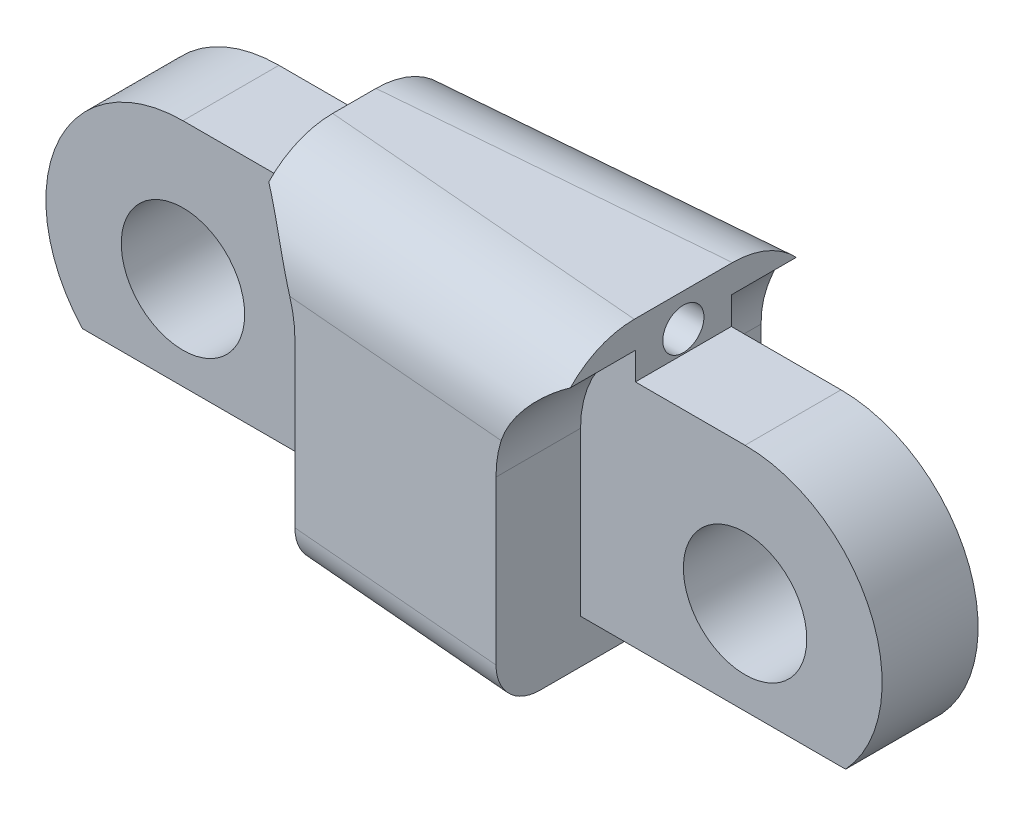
ISO-10303-21;
HEADER;
FILE_DESCRIPTION(('STEP AP214'),'2;1');
FILE_NAME('part.step','',(''),(''),'','','');
FILE_SCHEMA(('AUTOMOTIVE_DESIGN { 1 0 10303 214 1 1 1 1 }'));
ENDSEC;
DATA;
#1=APPLICATION_CONTEXT('core data for automotive mechanical design processes');
#2=APPLICATION_PROTOCOL_DEFINITION('international standard','automotive_design',2000,#1);
#3=PRODUCT_CONTEXT('',#1,'mechanical');
#4=PRODUCT('Part','Part','',(#3));
#5=PRODUCT_RELATED_PRODUCT_CATEGORY('part','',(#4));
#6=PRODUCT_DEFINITION_FORMATION('','',#4);
#7=PRODUCT_DEFINITION_CONTEXT('part definition',#1,'design');
#8=PRODUCT_DEFINITION('design','',#6,#7);
#9=PRODUCT_DEFINITION_SHAPE('','',#8);
#10=(LENGTH_UNIT() NAMED_UNIT(*) SI_UNIT(.MILLI.,.METRE.));
#11=(NAMED_UNIT(*) PLANE_ANGLE_UNIT() SI_UNIT($,.RADIAN.));
#12=(NAMED_UNIT(*) SI_UNIT($,.STERADIAN.) SOLID_ANGLE_UNIT());
#13=UNCERTAINTY_MEASURE_WITH_UNIT(LENGTH_MEASURE(1.E-05),#10,'distance_accuracy_value','');
#14=(GEOMETRIC_REPRESENTATION_CONTEXT(3) GLOBAL_UNCERTAINTY_ASSIGNED_CONTEXT((#13)) GLOBAL_UNIT_ASSIGNED_CONTEXT((#10,
#11,#12)) REPRESENTATION_CONTEXT('',''));
#15=CARTESIAN_POINT('',(0.,0.,0.));
#16=DIRECTION('',(0.,0.,1.));
#17=DIRECTION('',(1.,0.,0.));
#18=AXIS2_PLACEMENT_3D('',#15,#16,#17);
#19=CARTESIAN_POINT('',(0.,0.,0.));
#20=DIRECTION('',(0.,-1.,0.));
#21=DIRECTION('',(0.,0.,-1.));
#22=AXIS2_PLACEMENT_3D('',#19,#20,#21);
#23=PLANE('',#22);
#24=DIRECTION('',(0.,0.,-1.));
#25=VECTOR('',#24,1.);
#26=CARTESIAN_POINT('',(3.175,0.,7.9375));
#27=LINE('',#26,#25);
#28=CARTESIAN_POINT('',(3.175,0.,4.06577914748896));
#29=VERTEX_POINT('',#28);
#30=CARTESIAN_POINT('',(3.175,0.,-4.06577914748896));
#31=VERTEX_POINT('',#30);
#32=EDGE_CURVE('E503',#29,#31,#27,.T.);
#33=ORIENTED_EDGE('',*,*,#32,.T.);
#34=DIRECTION('',(-0.99654575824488,0.,0.08304547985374));
#35=VECTOR('',#34,1.);
#36=CARTESIAN_POINT('',(19.2609355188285,0.,-5.40627377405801));
#37=LINE('',#36,#35);
#38=CARTESIAN_POINT('',(15.875,0.,-5.1241124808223));
#39=VERTEX_POINT('',#38);
#40=EDGE_CURVE('E378',#31,#39,#37,.F.);
#41=ORIENTED_EDGE('',*,*,#40,.T.);
#42=DIRECTION('',(0.,0.,-1.));
#43=VECTOR('',#42,1.);
#44=CARTESIAN_POINT('',(15.875,0.,7.9375));
#45=LINE('',#44,#43);
#46=CARTESIAN_POINT('',(15.875,0.,5.1241124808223));
#47=VERTEX_POINT('',#46);
#48=EDGE_CURVE('E282',#47,#39,#45,.T.);
#49=ORIENTED_EDGE('',*,*,#48,.F.);
#50=DIRECTION('',(0.99654575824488,0.,0.08304547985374));
#51=VECTOR('',#50,1.);
#52=CARTESIAN_POINT('',(0.2109355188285,0.,3.818773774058));
#53=LINE('',#52,#51);
#54=EDGE_CURVE('E375',#47,#29,#53,.F.);
#55=ORIENTED_EDGE('',*,*,#54,.T.);
#56=EDGE_LOOP('',(#33,#41,#49,#55));
#57=FACE_BOUND('',#56,.T.);
#58=ADVANCED_FACE('F36',(#57),#23,.T.);
#59=CARTESIAN_POINT('',(-7.14375,0.,-2.778125));
#60=DIRECTION('',(0.,0.,1.));
#61=DIRECTION('',(1.,0.,0.));
#62=AXIS2_PLACEMENT_3D('',#59,#60,#61);
#63=PLANE('',#62);
#64=CARTESIAN_POINT('',(-7.14375,7.9375,-2.778125));
#65=DIRECTION('',(0.,0.,1.));
#66=DIRECTION('',(1.,0.,0.));
#67=AXIS2_PLACEMENT_3D('',#64,#65,#66);
#68=CIRCLE('',#67,3.571875);
#69=CARTESIAN_POINT('',(-3.571875,7.9375,-2.778125));
#70=VERTEX_POINT('',#69);
#71=EDGE_CURVE('E303',#70,#70,#68,.T.);
#72=ORIENTED_EDGE('',*,*,#71,.T.);
#73=EDGE_LOOP('',(#72));
#74=FACE_BOUND('',#73,.T.);
#75=DIRECTION('',(1.,0.,0.));
#76=VECTOR('',#75,1.);
#77=CARTESIAN_POINT('',(-7.14375,2.54,-2.778125));
#78=LINE('',#77,#76);
#79=CARTESIAN_POINT('',(-12.9636211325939,2.54,-2.778125));
#80=VERTEX_POINT('',#79);
#81=CARTESIAN_POINT('',(3.175,2.54,-2.778125));
#82=VERTEX_POINT('',#81);
#83=EDGE_CURVE('E236',#80,#82,#78,.T.);
#84=ORIENTED_EDGE('',*,*,#83,.F.);
#85=CARTESIAN_POINT('',(-7.14375,7.9375,-2.778125));
#86=DIRECTION('',(0.,0.,1.));
#87=DIRECTION('',(1.,0.,0.));
#88=AXIS2_PLACEMENT_3D('',#85,#86,#87);
#89=CIRCLE('',#88,7.9375);
#90=CARTESIAN_POINT('',(-7.14375,15.875,-2.778125));
#91=VERTEX_POINT('',#90);
#92=EDGE_CURVE('E309',#91,#80,#89,.T.);
#93=ORIENTED_EDGE('',*,*,#92,.F.);
#94=DIRECTION('',(1.,0.,0.));
#95=VECTOR('',#94,1.);
#96=CARTESIAN_POINT('',(-7.14375,15.875,-2.778125));
#97=LINE('',#96,#95);
#98=CARTESIAN_POINT('',(0.,15.875,-2.778125));
#99=VERTEX_POINT('',#98);
#100=EDGE_CURVE('E323',#91,#99,#97,.T.);
#101=ORIENTED_EDGE('',*,*,#100,.T.);
#102=DIRECTION('',(0.,1.,0.));
#103=VECTOR('',#102,1.);
#104=CARTESIAN_POINT('',(0.,17.4625,-2.778125));
#105=LINE('',#104,#103);
#106=CARTESIAN_POINT('',(0.,17.4625,-2.778125));
#107=VERTEX_POINT('',#106);
#108=EDGE_CURVE('E582',#99,#107,#105,.T.);
#109=ORIENTED_EDGE('',*,*,#108,.T.);
#110=CARTESIAN_POINT('',(-3.175,11.9632386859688,-2.778125));
#111=DIRECTION('',(0.,0.,-1.));
#112=DIRECTION('',(1.,0.,0.));
#113=AXIS2_PLACEMENT_3D('',#110,#111,#112);
#114=CIRCLE('',#113,6.35);
#115=CARTESIAN_POINT('',(3.175,11.9632386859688,-2.778125));
#116=VERTEX_POINT('',#115);
#117=EDGE_CURVE('E579',#107,#116,#114,.T.);
#118=ORIENTED_EDGE('',*,*,#117,.T.);
#119=DIRECTION('',(0.,-1.,0.));
#120=VECTOR('',#119,1.);
#121=CARTESIAN_POINT('',(3.175,0.,-2.778125));
#122=LINE('',#121,#120);
#123=EDGE_CURVE('E577',#116,#82,#122,.T.);
#124=ORIENTED_EDGE('',*,*,#123,.T.);
#125=EDGE_LOOP('',(#84,#93,#101,#109,#118,#124));
#126=FACE_BOUND('',#125,.T.);
#127=ADVANCED_FACE('F431',(#74,#126),#63,.F.);
#128=CARTESIAN_POINT('',(-7.14375,0.,2.778125));
#129=DIRECTION('',(0.,0.,-1.));
#130=DIRECTION('',(-1.,0.,0.));
#131=AXIS2_PLACEMENT_3D('',#128,#129,#130);
#132=PLANE('',#131);
#133=CARTESIAN_POINT('',(-7.14375,7.9375,2.778125));
#134=DIRECTION('',(0.,0.,1.));
#135=DIRECTION('',(1.,0.,0.));
#136=AXIS2_PLACEMENT_3D('',#133,#134,#135);
#137=CIRCLE('',#136,3.571875);
#138=CARTESIAN_POINT('',(-3.571875,7.9375,2.778125));
#139=VERTEX_POINT('',#138);
#140=EDGE_CURVE('E299',#139,#139,#137,.T.);
#141=ORIENTED_EDGE('',*,*,#140,.F.);
#142=EDGE_LOOP('',(#141));
#143=FACE_BOUND('',#142,.T.);
#144=DIRECTION('',(1.,0.,0.));
#145=VECTOR('',#144,1.);
#146=CARTESIAN_POINT('',(3.175,2.54,2.778125));
#147=LINE('',#146,#145);
#148=CARTESIAN_POINT('',(-12.9636211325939,2.54,2.778125));
#149=VERTEX_POINT('',#148);
#150=CARTESIAN_POINT('',(3.175,2.54,2.778125));
#151=VERTEX_POINT('',#150);
#152=EDGE_CURVE('E233',#149,#151,#147,.T.);
#153=ORIENTED_EDGE('',*,*,#152,.T.);
#154=DIRECTION('',(0.,-1.,0.));
#155=VECTOR('',#154,1.);
#156=CARTESIAN_POINT('',(3.175,0.,2.778125));
#157=LINE('',#156,#155);
#158=CARTESIAN_POINT('',(3.175,11.9632386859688,2.778125));
#159=VERTEX_POINT('',#158);
#160=EDGE_CURVE('E567',#159,#151,#157,.T.);
#161=ORIENTED_EDGE('',*,*,#160,.F.);
#162=CARTESIAN_POINT('',(-3.175,11.9632386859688,2.778125));
#163=DIRECTION('',(0.,0.,-1.));
#164=DIRECTION('',(1.,0.,0.));
#165=AXIS2_PLACEMENT_3D('',#162,#163,#164);
#166=CIRCLE('',#165,6.35);
#167=CARTESIAN_POINT('',(0.,17.4625,2.778125));
#168=VERTEX_POINT('',#167);
#169=EDGE_CURVE('E564',#168,#159,#166,.T.);
#170=ORIENTED_EDGE('',*,*,#169,.F.);
#171=DIRECTION('',(0.,1.,0.));
#172=VECTOR('',#171,1.);
#173=CARTESIAN_POINT('',(0.,17.4625,2.778125));
#174=LINE('',#173,#172);
#175=CARTESIAN_POINT('',(0.,15.875,2.778125));
#176=VERTEX_POINT('',#175);
#177=EDGE_CURVE('E560',#176,#168,#174,.T.);
#178=ORIENTED_EDGE('',*,*,#177,.F.);
#179=DIRECTION('',(1.,0.,0.));
#180=VECTOR('',#179,1.);
#181=CARTESIAN_POINT('',(-7.14375,15.875,2.778125));
#182=LINE('',#181,#180);
#183=CARTESIAN_POINT('',(-7.14375,15.875,2.778125));
#184=VERTEX_POINT('',#183);
#185=EDGE_CURVE('E328',#184,#176,#182,.T.);
#186=ORIENTED_EDGE('',*,*,#185,.F.);
#187=CARTESIAN_POINT('',(-7.14375,7.9375,2.778125));
#188=DIRECTION('',(0.,0.,1.));
#189=DIRECTION('',(1.,0.,0.));
#190=AXIS2_PLACEMENT_3D('',#187,#188,#189);
#191=CIRCLE('',#190,7.9375);
#192=EDGE_CURVE('E312',#184,#149,#191,.T.);
#193=ORIENTED_EDGE('',*,*,#192,.T.);
#194=EDGE_LOOP('',(#153,#161,#170,#178,#186,#193));
#195=FACE_BOUND('',#194,.T.);
#196=ADVANCED_FACE('F419',(#143,#195),#132,.F.);
#197=CARTESIAN_POINT('',(-7.14375,7.9375,-2.778125));
#198=DIRECTION('',(0.,0.,1.));
#199=DIRECTION('',(1.,0.,0.));
#200=AXIS2_PLACEMENT_3D('',#197,#198,#199);
#201=CYLINDRICAL_SURFACE('',#200,7.9375);
#202=DIRECTION('',(0.,0.,1.));
#203=VECTOR('',#202,1.);
#204=CARTESIAN_POINT('',(-12.9636211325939,2.54,-2.778125));
#205=LINE('',#204,#203);
#206=EDGE_CURVE('E237',#149,#80,#205,.F.);
#207=ORIENTED_EDGE('',*,*,#206,.F.);
#208=ORIENTED_EDGE('',*,*,#192,.F.);
#209=DIRECTION('',(0.,0.,-1.));
#210=VECTOR('',#209,1.);
#211=CARTESIAN_POINT('',(-7.14375,15.875,-2.778125));
#212=LINE('',#211,#210);
#213=EDGE_CURVE('E320',#184,#91,#212,.T.);
#214=ORIENTED_EDGE('',*,*,#213,.T.);
#215=ORIENTED_EDGE('',*,*,#92,.T.);
#216=EDGE_LOOP('',(#207,#208,#214,#215));
#217=FACE_BOUND('',#216,.T.);
#218=ADVANCED_FACE('F415',(#217),#201,.T.);
#219=CARTESIAN_POINT('',(0.,19.05,6.35));
#220=DIRECTION('',(1.,0.,0.));
#221=DIRECTION('',(0.,0.,-1.));
#222=AXIS2_PLACEMENT_3D('',#219,#220,#221);
#223=PLANE('',#222);
#224=CARTESIAN_POINT('',(0.,17.145,0.));
#225=DIRECTION('',(1.,0.,0.));
#226=DIRECTION('',(0.,0.,-1.));
#227=AXIS2_PLACEMENT_3D('',#224,#225,#226);
#228=CIRCLE('',#227,1.190625);
#229=CARTESIAN_POINT('',(0.,17.145,-1.190625));
#230=VERTEX_POINT('',#229);
#231=EDGE_CURVE('E584',#230,#230,#228,.F.);
#232=ORIENTED_EDGE('',*,*,#231,.F.);
#233=EDGE_LOOP('',(#232));
#234=FACE_BOUND('',#233,.T.);
#235=DIRECTION('',(0.,0.,1.));
#236=VECTOR('',#235,1.);
#237=CARTESIAN_POINT('',(0.,17.4625,-7.9375));
#238=LINE('',#237,#236);
#239=CARTESIAN_POINT('',(0.,17.4625,-4.95419519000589));
#240=VERTEX_POINT('',#239);
#241=EDGE_CURVE('E573',#240,#107,#238,.T.);
#242=ORIENTED_EDGE('',*,*,#241,.T.);
#243=ORIENTED_EDGE('',*,*,#108,.F.);
#244=DIRECTION('',(0.,0.,-1.));
#245=VECTOR('',#244,1.);
#246=CARTESIAN_POINT('',(0.,15.875,-2.778125));
#247=LINE('',#246,#245);
#248=EDGE_CURVE('E319',#176,#99,#247,.T.);
#249=ORIENTED_EDGE('',*,*,#248,.F.);
#250=ORIENTED_EDGE('',*,*,#177,.T.);
#251=DIRECTION('',(0.,0.,-1.));
#252=VECTOR('',#251,1.);
#253=CARTESIAN_POINT('',(0.,17.4625,7.9375));
#254=LINE('',#253,#252);
#255=CARTESIAN_POINT('',(0.,17.4625,4.95419519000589));
#256=VERTEX_POINT('',#255);
#257=EDGE_CURVE('E540',#256,#168,#254,.T.);
#258=ORIENTED_EDGE('',*,*,#257,.F.);
#259=CARTESIAN_POINT('',(0.,13.97,1.25239162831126));
#260=DIRECTION('',(1.,0.,0.));
#261=DIRECTION('',(0.,0.,1.));
#262=AXIS2_PLACEMENT_3D('',#259,#260,#261);
#263=ELLIPSE('',#262,5.09760837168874,5.08);
#264=CARTESIAN_POINT('',(0.,19.05,1.25239162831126));
#265=VERTEX_POINT('',#264);
#266=EDGE_CURVE('E355',#256,#265,#263,.F.);
#267=ORIENTED_EDGE('',*,*,#266,.T.);
#268=DIRECTION('',(0.,0.,1.));
#269=VECTOR('',#268,1.);
#270=CARTESIAN_POINT('',(0.,19.05,6.35));
#271=LINE('',#270,#269);
#272=CARTESIAN_POINT('',(0.,19.05,-1.25239162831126));
#273=VERTEX_POINT('',#272);
#274=EDGE_CURVE('E343',#273,#265,#271,.T.);
#275=ORIENTED_EDGE('',*,*,#274,.F.);
#276=CARTESIAN_POINT('',(0.,13.97,-1.25239162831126));
#277=DIRECTION('',(1.,0.,0.));
#278=DIRECTION('',(0.,0.,1.));
#279=AXIS2_PLACEMENT_3D('',#276,#277,#278);
#280=ELLIPSE('',#279,5.09760837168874,5.08);
#281=EDGE_CURVE('E357',#273,#240,#280,.F.);
#282=ORIENTED_EDGE('',*,*,#281,.T.);
#283=EDGE_LOOP('',(#242,#243,#249,#250,#258,#267,#275,#282));
#284=FACE_BOUND('',#283,.T.);
#285=ADVANCED_FACE('F418',(#234,#284),#223,.F.);
#286=CARTESIAN_POINT('',(0.,19.05,-6.35));
#287=DIRECTION('',(0.08304547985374,0.,0.99654575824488));
#288=DIRECTION('',(0.99654575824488,0.,-0.08304547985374));
#289=AXIS2_PLACEMENT_3D('',#286,#287,#288);
#290=PLANE('',#289);
#291=CARTESIAN_POINT('',(-3.175,11.9632386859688,-6.08541666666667));
#292=DIRECTION('',(0.08304547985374,0.,0.99654575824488));
#293=DIRECTION('',(-0.99654575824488,0.,0.08304547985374));
#294=AXIS2_PLACEMENT_3D('',#291,#292,#293);
#295=ELLIPSE('',#294,6.37201046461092,6.35);
#296=CARTESIAN_POINT('',(2.8495671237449,13.97,-6.58746392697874));
#297=VERTEX_POINT('',#296);
#298=CARTESIAN_POINT('',(3.175,11.9632386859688,-6.61458333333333));
#299=VERTEX_POINT('',#298);
#300=EDGE_CURVE('E569',#297,#299,#295,.F.);
#301=ORIENTED_EDGE('',*,*,#300,.F.);
#302=DIRECTION('',(-0.99654575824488,0.,0.08304547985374));
#303=VECTOR('',#302,1.);
#304=CARTESIAN_POINT('',(0.,13.97,-6.35));
#305=LINE('',#304,#303);
#306=CARTESIAN_POINT('',(16.2004328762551,13.97,-7.70003607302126));
#307=VERTEX_POINT('',#306);
#308=EDGE_CURVE('E360',#297,#307,#305,.F.);
#309=ORIENTED_EDGE('',*,*,#308,.T.);
#310=CARTESIAN_POINT('',(22.225,11.9632386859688,-8.20208333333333));
#311=DIRECTION('',(0.08304547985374,0.,0.99654575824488));
#312=DIRECTION('',(-0.99654575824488,0.,0.08304547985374));
#313=AXIS2_PLACEMENT_3D('',#310,#311,#312);
#314=ELLIPSE('',#313,6.37201046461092,6.35);
#315=CARTESIAN_POINT('',(15.875,11.9632386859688,-7.67291666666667));
#316=VERTEX_POINT('',#315);
#317=EDGE_CURVE('E524',#307,#316,#314,.T.);
#318=ORIENTED_EDGE('',*,*,#317,.T.);
#319=DIRECTION('',(0.,-1.,0.));
#320=VECTOR('',#319,1.);
#321=CARTESIAN_POINT('',(15.875,19.05,-7.67291666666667));
#322=LINE('',#321,#320);
#323=CARTESIAN_POINT('',(15.875,2.54,-7.67291666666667));
#324=VERTEX_POINT('',#323);
#325=EDGE_CURVE('E521',#316,#324,#322,.T.);
#326=ORIENTED_EDGE('',*,*,#325,.T.);
#327=DIRECTION('',(-0.99654575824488,0.,0.08304547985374));
#328=VECTOR('',#327,1.);
#329=CARTESIAN_POINT('',(0.,2.54,-6.35));
#330=LINE('',#329,#328);
#331=CARTESIAN_POINT('',(3.175,2.54,-6.61458333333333));
#332=VERTEX_POINT('',#331);
#333=EDGE_CURVE('E370',#324,#332,#330,.T.);
#334=ORIENTED_EDGE('',*,*,#333,.T.);
#335=DIRECTION('',(0.,-1.,0.));
#336=VECTOR('',#335,1.);
#337=CARTESIAN_POINT('',(3.17500000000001,19.05,-6.61458333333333));
#338=LINE('',#337,#336);
#339=EDGE_CURVE('E571',#299,#332,#338,.T.);
#340=ORIENTED_EDGE('',*,*,#339,.F.);
#341=EDGE_LOOP('',(#301,#309,#318,#326,#334,#340));
#342=FACE_BOUND('',#341,.T.);
#343=ADVANCED_FACE('F464',(#342),#290,.F.);
#344=CARTESIAN_POINT('',(-0.103646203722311,13.97,-1.24375444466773));
#345=DIRECTION('',(-0.99654575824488,0.,0.08304547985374));
#346=DIRECTION('',(0.08304547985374,0.,0.99654575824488));
#347=AXIS2_PLACEMENT_3D('',#344,#345,#346);
#348=CYLINDRICAL_SURFACE('',#347,5.08);
#349=ORIENTED_EDGE('',*,*,#308,.F.);
#350=CARTESIAN_POINT('',(2.8495671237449,13.97,-6.58746392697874));
#351=CARTESIAN_POINT('',(2.80548358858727,14.1024553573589,-6.58381457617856));
#352=CARTESIAN_POINT('',(2.75704308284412,14.23320874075,-6.57455748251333));
#353=CARTESIAN_POINT('',(2.65222898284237,14.4900926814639,-6.54587044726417));
#354=CARTESIAN_POINT('',(2.59586939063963,14.6162309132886,-6.52645829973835));
#355=CARTESIAN_POINT('',(2.47655169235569,14.8616695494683,-6.47876870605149));
#356=CARTESIAN_POINT('',(2.41367987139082,14.9810333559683,-6.45059924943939));
#357=CARTESIAN_POINT('',(2.28148017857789,15.213971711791,-6.3863770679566));
#358=CARTESIAN_POINT('',(2.2121490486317,15.3275432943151,-6.35032035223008));
#359=CARTESIAN_POINT('',(2.05111294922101,15.5738597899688,-6.26229037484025));
#360=CARTESIAN_POINT('',(1.95792788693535,15.7050126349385,-6.20856358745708));
#361=CARTESIAN_POINT('',(1.7639792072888,15.9575288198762,-6.09262644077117));
#362=CARTESIAN_POINT('',(1.66321402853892,16.0788901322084,-6.0304143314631));
#363=CARTESIAN_POINT('',(1.34978372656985,16.429498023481,-5.83284218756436));
#364=CARTESIAN_POINT('',(1.12687357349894,16.6439329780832,-5.68705578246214));
#365=CARTESIAN_POINT('',(0.751417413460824,16.9572261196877,-5.44064403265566));
#366=CARTESIAN_POINT('',(0.60562568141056,17.0683972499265,-5.34477313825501));
#367=CARTESIAN_POINT('',(0.381893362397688,17.2243378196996,-5.19903492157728));
#368=CARTESIAN_POINT('',(0.306812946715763,17.274320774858,-5.15034972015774));
#369=CARTESIAN_POINT('',(0.154795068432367,17.3709250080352,-5.05252873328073));
#370=CARTESIAN_POINT('',(0.0778574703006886,17.4175460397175,-5.00339291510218));
#371=CARTESIAN_POINT('',(0.,17.4625,-4.95419519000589));
#372=B_SPLINE_CURVE_WITH_KNOTS('',3,(#350,#351,#352,#353,#354,#355,#356,#357,#358,#359,#360,
#361,#362,#363,#364,#365,#366,#367,#368,#369,#370,#371),.UNSPECIFIED.,.F.,.F.,(4,2,2,2,2,2,2,2,
2,2,4),(0.,0.418616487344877,0.836501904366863,1.24942597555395,1.66255946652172,
2.17063862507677,2.67882272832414,3.70018046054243,4.32034796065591,4.62776522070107,
4.93520498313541),.UNSPECIFIED.);
#373=EDGE_CURVE('E11',#297,#240,#372,.T.);
#374=ORIENTED_EDGE('',*,*,#373,.T.);
#375=ORIENTED_EDGE('',*,*,#281,.F.);
#376=DIRECTION('',(-0.99654575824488,0.,0.08304547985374));
#377=VECTOR('',#376,1.);
#378=CARTESIAN_POINT('',(-0.103646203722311,19.05,-1.24375444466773));
#379=LINE('',#378,#377);
#380=CARTESIAN_POINT('',(19.05,19.05,-2.83989162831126));
#381=VERTEX_POINT('',#380);
#382=EDGE_CURVE('E352',#381,#273,#379,.T.);
#383=ORIENTED_EDGE('',*,*,#382,.F.);
#384=CARTESIAN_POINT('',(19.05,13.97,-2.83989162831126));
#385=DIRECTION('',(-1.,0.,0.));
#386=DIRECTION('',(0.,0.,1.));
#387=AXIS2_PLACEMENT_3D('',#384,#385,#386);
#388=ELLIPSE('',#387,5.09760837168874,5.08);
#389=CARTESIAN_POINT('',(19.05,17.4625,-6.54169519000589));
#390=VERTEX_POINT('',#389);
#391=EDGE_CURVE('E365',#390,#381,#388,.F.);
#392=ORIENTED_EDGE('',*,*,#391,.F.);
#393=CARTESIAN_POINT('',(16.2004328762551,13.97,-7.70003607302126));
#394=CARTESIAN_POINT('',(16.2459125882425,14.1066453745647,-7.70385183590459));
#395=CARTESIAN_POINT('',(16.2961256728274,14.2417843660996,-7.70248009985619));
#396=CARTESIAN_POINT('',(16.4053664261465,14.5078208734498,-7.69022397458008));
#397=CARTESIAN_POINT('',(16.4643829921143,14.6387234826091,-7.67935148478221));
#398=CARTESIAN_POINT('',(16.5900649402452,14.8941247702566,-7.64911310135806));
#399=CARTESIAN_POINT('',(16.6566481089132,15.0186743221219,-7.6298330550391));
#400=CARTESIAN_POINT('',(16.7972730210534,15.2620338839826,-7.58373868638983));
#401=CARTESIAN_POINT('',(16.8713168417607,15.3808422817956,-7.55692226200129));
#402=CARTESIAN_POINT('',(17.1028658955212,15.7265889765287,-7.46689953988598));
#403=CARTESIAN_POINT('',(17.2705213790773,15.9443206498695,-7.39392524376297));
#404=CARTESIAN_POINT('',(17.6287072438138,16.3531046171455,-7.22909100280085));
#405=CARTESIAN_POINT('',(17.8193215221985,16.544053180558,-7.13716086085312));
#406=CARTESIAN_POINT('',(18.1801421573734,16.8629945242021,-6.96106463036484));
#407=CARTESIAN_POINT('',(18.3469728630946,16.9959794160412,-6.87893594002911));
#408=CARTESIAN_POINT('',(18.6050880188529,17.181464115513,-6.75334714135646));
#409=CARTESIAN_POINT('',(18.6921709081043,17.2408063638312,-6.71121206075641));
#410=CARTESIAN_POINT('',(18.8690548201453,17.3550097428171,-6.62658955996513));
#411=CARTESIAN_POINT('',(18.9588557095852,17.4098710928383,-6.58410215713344));
#412=CARTESIAN_POINT('',(19.05,17.4625,-6.54169519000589));
#413=B_SPLINE_CURVE_WITH_KNOTS('',3,(#393,#394,#395,#396,#397,#398,#399,#400,#401,#402,#403,
#404,#405,#406,#407,#408,#409,#410,#411,#412),.UNSPECIFIED.,.F.,.F.,(4,2,2,2,2,2,2,2,2,4),(0.,
0.431914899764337,0.863289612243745,1.29035919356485,1.71754801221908,2.56701807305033,
3.41969227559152,4.10441363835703,4.44478206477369,4.78513381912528),.UNSPECIFIED.);
#414=EDGE_CURVE('E473',#307,#390,#413,.T.);
#415=ORIENTED_EDGE('',*,*,#414,.F.);
#416=EDGE_LOOP('',(#349,#374,#375,#383,#392,#415));
#417=FACE_BOUND('',#416,.T.);
#418=ADVANCED_FACE('F467',(#417),#348,.T.);
#419=CARTESIAN_POINT('',(0.2109355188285,2.54,-3.818773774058));
#420=DIRECTION('',(0.99654575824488,0.,-0.08304547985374));
#421=DIRECTION('',(-0.08304547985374,0.,-0.99654575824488));
#422=AXIS2_PLACEMENT_3D('',#419,#420,#421);
#423=CYLINDRICAL_SURFACE('',#422,2.54);
#424=ORIENTED_EDGE('',*,*,#40,.F.);
#425=CARTESIAN_POINT('',(3.175,2.54,-4.06577914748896));
#426=DIRECTION('',(-1.,0.,0.));
#427=DIRECTION('',(0.,0.,-1.));
#428=AXIS2_PLACEMENT_3D('',#425,#426,#427);
#429=ELLIPSE('',#428,2.54880418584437,2.54);
#430=EDGE_CURVE('E50',#31,#332,#429,.F.);
#431=ORIENTED_EDGE('',*,*,#430,.T.);
#432=ORIENTED_EDGE('',*,*,#333,.F.);
#433=CARTESIAN_POINT('',(15.875,2.54,-5.1241124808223));
#434=DIRECTION('',(-1.,0.,0.));
#435=DIRECTION('',(0.,0.,-1.));
#436=AXIS2_PLACEMENT_3D('',#433,#434,#435);
#437=ELLIPSE('',#436,2.54880418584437,2.54);
#438=EDGE_CURVE('E395',#39,#324,#437,.F.);
#439=ORIENTED_EDGE('',*,*,#438,.F.);
#440=EDGE_LOOP('',(#424,#431,#432,#439));
#441=FACE_BOUND('',#440,.T.);
#442=ADVANCED_FACE('F457',(#441),#423,.T.);
#443=CARTESIAN_POINT('',(19.05,19.05,-7.9375));
#444=DIRECTION('',(-1.,0.,0.));
#445=DIRECTION('',(0.,0.,1.));
#446=AXIS2_PLACEMENT_3D('',#443,#444,#445);
#447=PLANE('',#446);
#448=CARTESIAN_POINT('',(19.05,17.145,0.));
#449=DIRECTION('',(1.,0.,0.));
#450=DIRECTION('',(0.,0.,-1.));
#451=AXIS2_PLACEMENT_3D('',#448,#449,#450);
#452=CIRCLE('',#451,1.190625);
#453=CARTESIAN_POINT('',(19.05,17.145,-1.190625));
#454=VERTEX_POINT('',#453);
#455=EDGE_CURVE('E587',#454,#454,#452,.T.);
#456=ORIENTED_EDGE('',*,*,#455,.F.);
#457=EDGE_LOOP('',(#456));
#458=FACE_BOUND('',#457,.T.);
#459=DIRECTION('',(0.,1.,0.));
#460=VECTOR('',#459,1.);
#461=CARTESIAN_POINT('',(19.05,17.4625,-2.778125));
#462=LINE('',#461,#460);
#463=CARTESIAN_POINT('',(19.05,15.875,-2.778125));
#464=VERTEX_POINT('',#463);
#465=CARTESIAN_POINT('',(19.05,17.4625,-2.778125));
#466=VERTEX_POINT('',#465);
#467=EDGE_CURVE('E514',#464,#466,#462,.T.);
#468=ORIENTED_EDGE('',*,*,#467,.T.);
#469=DIRECTION('',(0.,0.,1.));
#470=VECTOR('',#469,1.);
#471=CARTESIAN_POINT('',(19.05,17.4625,-7.9375));
#472=LINE('',#471,#470);
#473=EDGE_CURVE('E517',#390,#466,#472,.T.);
#474=ORIENTED_EDGE('',*,*,#473,.F.);
#475=ORIENTED_EDGE('',*,*,#391,.T.);
#476=DIRECTION('',(0.,0.,-1.));
#477=VECTOR('',#476,1.);
#478=CARTESIAN_POINT('',(19.05,19.05,-7.9375));
#479=LINE('',#478,#477);
#480=CARTESIAN_POINT('',(19.05,19.05,2.83989162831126));
#481=VERTEX_POINT('',#480);
#482=EDGE_CURVE('E346',#481,#381,#479,.T.);
#483=ORIENTED_EDGE('',*,*,#482,.F.);
#484=CARTESIAN_POINT('',(19.05,13.97,2.83989162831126));
#485=DIRECTION('',(-1.,0.,0.));
#486=DIRECTION('',(0.,0.,1.));
#487=AXIS2_PLACEMENT_3D('',#484,#485,#486);
#488=ELLIPSE('',#487,5.09760837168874,5.08);
#489=CARTESIAN_POINT('',(19.05,17.4625,6.54169519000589));
#490=VERTEX_POINT('',#489);
#491=EDGE_CURVE('E362',#481,#490,#488,.F.);
#492=ORIENTED_EDGE('',*,*,#491,.T.);
#493=DIRECTION('',(0.,0.,-1.));
#494=VECTOR('',#493,1.);
#495=CARTESIAN_POINT('',(19.05,17.4625,7.9375));
#496=LINE('',#495,#494);
#497=CARTESIAN_POINT('',(19.05,17.4625,2.778125));
#498=VERTEX_POINT('',#497);
#499=EDGE_CURVE('E291',#490,#498,#496,.T.);
#500=ORIENTED_EDGE('',*,*,#499,.T.);
#501=DIRECTION('',(0.,1.,0.));
#502=VECTOR('',#501,1.);
#503=CARTESIAN_POINT('',(19.05,17.4625,2.778125));
#504=LINE('',#503,#502);
#505=CARTESIAN_POINT('',(19.05,15.875,2.778125));
#506=VERTEX_POINT('',#505);
#507=EDGE_CURVE('E286',#506,#498,#504,.T.);
#508=ORIENTED_EDGE('',*,*,#507,.F.);
#509=DIRECTION('',(0.,0.,1.));
#510=VECTOR('',#509,1.);
#511=CARTESIAN_POINT('',(19.05,15.875,2.778125));
#512=LINE('',#511,#510);
#513=EDGE_CURVE('E331',#464,#506,#512,.T.);
#514=ORIENTED_EDGE('',*,*,#513,.F.);
#515=EDGE_LOOP('',(#468,#474,#475,#483,#492,#500,#508,#514));
#516=FACE_BOUND('',#515,.T.);
#517=ADVANCED_FACE('F453',(#458,#516),#447,.F.);
#518=CARTESIAN_POINT('',(0.,19.05,6.35));
#519=DIRECTION('',(0.08304547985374,0.,-0.99654575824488));
#520=DIRECTION('',(-0.99654575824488,0.,-0.08304547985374));
#521=AXIS2_PLACEMENT_3D('',#518,#519,#520);
#522=PLANE('',#521);
#523=CARTESIAN_POINT('',(-3.175,11.9632386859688,6.08541666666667));
#524=DIRECTION('',(0.08304547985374,0.,-0.99654575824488));
#525=DIRECTION('',(-0.99654575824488,0.,-0.08304547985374));
#526=AXIS2_PLACEMENT_3D('',#523,#524,#525);
#527=ELLIPSE('',#526,6.37201046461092,6.35);
#528=CARTESIAN_POINT('',(2.8495671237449,13.97,6.58746392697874));
#529=VERTEX_POINT('',#528);
#530=CARTESIAN_POINT('',(3.175,11.9632386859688,6.61458333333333));
#531=VERTEX_POINT('',#530);
#532=EDGE_CURVE('E502',#529,#531,#527,.T.);
#533=ORIENTED_EDGE('',*,*,#532,.T.);
#534=DIRECTION('',(0.,-1.,0.));
#535=VECTOR('',#534,1.);
#536=CARTESIAN_POINT('',(3.17500000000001,19.05,6.61458333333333));
#537=LINE('',#536,#535);
#538=CARTESIAN_POINT('',(3.175,2.54,6.61458333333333));
#539=VERTEX_POINT('',#538);
#540=EDGE_CURVE('E507',#531,#539,#537,.T.);
#541=ORIENTED_EDGE('',*,*,#540,.T.);
#542=DIRECTION('',(0.99654575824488,0.,0.08304547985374));
#543=VECTOR('',#542,1.);
#544=CARTESIAN_POINT('',(19.05,2.54,7.9375));
#545=LINE('',#544,#543);
#546=CARTESIAN_POINT('',(15.875,2.54,7.67291666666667));
#547=VERTEX_POINT('',#546);
#548=EDGE_CURVE('E381',#539,#547,#545,.T.);
#549=ORIENTED_EDGE('',*,*,#548,.T.);
#550=DIRECTION('',(0.,-1.,0.));
#551=VECTOR('',#550,1.);
#552=CARTESIAN_POINT('',(15.875,19.05,7.67291666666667));
#553=LINE('',#552,#551);
#554=CARTESIAN_POINT('',(15.875,11.9632386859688,7.67291666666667));
#555=VERTEX_POINT('',#554);
#556=EDGE_CURVE('E294',#555,#547,#553,.T.);
#557=ORIENTED_EDGE('',*,*,#556,.F.);
#558=CARTESIAN_POINT('',(22.225,11.9632386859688,8.20208333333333));
#559=DIRECTION('',(0.08304547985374,0.,-0.99654575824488));
#560=DIRECTION('',(-0.99654575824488,0.,-0.08304547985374));
#561=AXIS2_PLACEMENT_3D('',#558,#559,#560);
#562=ELLIPSE('',#561,6.37201046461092,6.35);
#563=CARTESIAN_POINT('',(16.2004328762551,13.97,7.70003607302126));
#564=VERTEX_POINT('',#563);
#565=EDGE_CURVE('E297',#564,#555,#562,.F.);
#566=ORIENTED_EDGE('',*,*,#565,.F.);
#567=DIRECTION('',(0.99654575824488,0.,0.08304547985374));
#568=VECTOR('',#567,1.);
#569=CARTESIAN_POINT('',(0.,13.97,6.35));
#570=LINE('',#569,#568);
#571=EDGE_CURVE('E367',#564,#529,#570,.F.);
#572=ORIENTED_EDGE('',*,*,#571,.T.);
#573=EDGE_LOOP('',(#533,#541,#549,#557,#566,#572));
#574=FACE_BOUND('',#573,.T.);
#575=ADVANCED_FACE('F456',(#574),#522,.F.);
#576=CARTESIAN_POINT('',(-0.103646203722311,13.97,1.24375444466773));
#577=DIRECTION('',(0.99654575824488,0.,0.08304547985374));
#578=DIRECTION('',(0.08304547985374,0.,-0.99654575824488));
#579=AXIS2_PLACEMENT_3D('',#576,#577,#578);
#580=CYLINDRICAL_SURFACE('',#579,5.08);
#581=CARTESIAN_POINT('',(2.8495671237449,13.97,6.58746392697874));
#582=CARTESIAN_POINT('',(2.80548358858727,14.1024553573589,6.58381457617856));
#583=CARTESIAN_POINT('',(2.75704308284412,14.23320874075,6.57455748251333));
#584=CARTESIAN_POINT('',(2.65222898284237,14.4900926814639,6.54587044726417));
#585=CARTESIAN_POINT('',(2.59586939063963,14.6162309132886,6.52645829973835));
#586=CARTESIAN_POINT('',(2.47655169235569,14.8616695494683,6.47876870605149));
#587=CARTESIAN_POINT('',(2.41367987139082,14.9810333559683,6.45059924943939));
#588=CARTESIAN_POINT('',(2.28148017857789,15.213971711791,6.3863770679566));
#589=CARTESIAN_POINT('',(2.2121490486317,15.3275432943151,6.35032035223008));
#590=CARTESIAN_POINT('',(2.05111294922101,15.5738597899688,6.26229037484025));
#591=CARTESIAN_POINT('',(1.95792788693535,15.7050126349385,6.20856358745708));
#592=CARTESIAN_POINT('',(1.7639792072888,15.9575288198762,6.09262644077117));
#593=CARTESIAN_POINT('',(1.66321402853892,16.0788901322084,6.0304143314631));
#594=CARTESIAN_POINT('',(1.34978372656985,16.429498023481,5.83284218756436));
#595=CARTESIAN_POINT('',(1.12687357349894,16.6439329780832,5.68705578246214));
#596=CARTESIAN_POINT('',(0.751417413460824,16.9572261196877,5.44064403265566));
#597=CARTESIAN_POINT('',(0.60562568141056,17.0683972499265,5.34477313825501));
#598=CARTESIAN_POINT('',(0.381893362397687,17.2243378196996,5.19903492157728));
#599=CARTESIAN_POINT('',(0.306812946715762,17.274320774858,5.15034972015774));
#600=CARTESIAN_POINT('',(0.154795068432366,17.3709250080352,5.05252873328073));
#601=CARTESIAN_POINT('',(0.0778574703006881,17.4175460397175,5.00339291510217));
#602=CARTESIAN_POINT('',(0.,17.4625,4.95419519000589));
#603=B_SPLINE_CURVE_WITH_KNOTS('',3,(#581,#582,#583,#584,#585,#586,#587,#588,#589,#590,#591,
#592,#593,#594,#595,#596,#597,#598,#599,#600,#601,#602),.UNSPECIFIED.,.F.,.F.,(4,2,2,2,2,2,2,2,
2,2,4),(0.,0.418616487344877,0.836501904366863,1.24942597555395,1.66255946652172,
2.17063862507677,2.67882272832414,3.70018046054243,4.32034796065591,4.62776522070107,
4.93520498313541),.UNSPECIFIED.);
#604=EDGE_CURVE('E495',#529,#256,#603,.T.);
#605=ORIENTED_EDGE('',*,*,#604,.F.);
#606=ORIENTED_EDGE('',*,*,#571,.F.);
#607=CARTESIAN_POINT('',(16.2004328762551,13.97,7.70003607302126));
#608=CARTESIAN_POINT('',(16.2459125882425,14.1066453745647,7.70385183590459));
#609=CARTESIAN_POINT('',(16.2961256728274,14.2417843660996,7.70248009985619));
#610=CARTESIAN_POINT('',(16.4053664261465,14.5078208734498,7.69022397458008));
#611=CARTESIAN_POINT('',(16.4643829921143,14.6387234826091,7.67935148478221));
#612=CARTESIAN_POINT('',(16.5900649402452,14.8941247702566,7.64911310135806));
#613=CARTESIAN_POINT('',(16.6566481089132,15.0186743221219,7.6298330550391));
#614=CARTESIAN_POINT('',(16.7972730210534,15.2620338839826,7.58373868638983));
#615=CARTESIAN_POINT('',(16.8713168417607,15.3808422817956,7.55692226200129));
#616=CARTESIAN_POINT('',(17.1028658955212,15.7265889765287,7.46689953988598));
#617=CARTESIAN_POINT('',(17.2705213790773,15.9443206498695,7.39392524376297));
#618=CARTESIAN_POINT('',(17.6287072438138,16.3531046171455,7.22909100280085));
#619=CARTESIAN_POINT('',(17.8193215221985,16.544053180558,7.13716086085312));
#620=CARTESIAN_POINT('',(18.1801421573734,16.8629945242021,6.96106463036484));
#621=CARTESIAN_POINT('',(18.3469728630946,16.9959794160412,6.87893594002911));
#622=CARTESIAN_POINT('',(18.6050880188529,17.181464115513,6.75334714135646));
#623=CARTESIAN_POINT('',(18.6921709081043,17.2408063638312,6.71121206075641));
#624=CARTESIAN_POINT('',(18.8690548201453,17.3550097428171,6.62658955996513));
#625=CARTESIAN_POINT('',(18.9588557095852,17.4098710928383,6.58410215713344));
#626=CARTESIAN_POINT('',(19.05,17.4625,6.54169519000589));
#627=B_SPLINE_CURVE_WITH_KNOTS('',3,(#607,#608,#609,#610,#611,#612,#613,#614,#615,#616,#617,
#618,#619,#620,#621,#622,#623,#624,#625,#626),.UNSPECIFIED.,.F.,.F.,(4,2,2,2,2,2,2,2,2,4),(0.,
0.431914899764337,0.863289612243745,1.29035919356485,1.71754801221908,2.56701807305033,
3.41969227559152,4.10441363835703,4.44478206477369,4.78513381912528),.UNSPECIFIED.);
#628=EDGE_CURVE('E386',#564,#490,#627,.T.);
#629=ORIENTED_EDGE('',*,*,#628,.T.);
#630=ORIENTED_EDGE('',*,*,#491,.F.);
#631=DIRECTION('',(0.99654575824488,0.,0.08304547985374));
#632=VECTOR('',#631,1.);
#633=CARTESIAN_POINT('',(-0.103646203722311,19.05,1.24375444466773));
#634=LINE('',#633,#632);
#635=EDGE_CURVE('E349',#265,#481,#634,.T.);
#636=ORIENTED_EDGE('',*,*,#635,.F.);
#637=ORIENTED_EDGE('',*,*,#266,.F.);
#638=EDGE_LOOP('',(#605,#606,#629,#630,#636,#637));
#639=FACE_BOUND('',#638,.T.);
#640=ADVANCED_FACE('F397',(#639),#580,.T.);
#641=CARTESIAN_POINT('',(0.2109355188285,2.54,3.818773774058));
#642=DIRECTION('',(-0.99654575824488,0.,-0.08304547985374));
#643=DIRECTION('',(-0.08304547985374,0.,0.99654575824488));
#644=AXIS2_PLACEMENT_3D('',#641,#642,#643);
#645=CYLINDRICAL_SURFACE('',#644,2.54);
#646=CARTESIAN_POINT('',(3.175,2.54,4.06577914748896));
#647=DIRECTION('',(1.,0.,0.));
#648=DIRECTION('',(0.,0.,-1.));
#649=AXIS2_PLACEMENT_3D('',#646,#647,#648);
#650=ELLIPSE('',#649,2.54880418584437,2.54);
#651=EDGE_CURVE('E479',#29,#539,#650,.F.);
#652=ORIENTED_EDGE('',*,*,#651,.F.);
#653=ORIENTED_EDGE('',*,*,#54,.F.);
#654=CARTESIAN_POINT('',(15.875,2.54,5.1241124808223));
#655=DIRECTION('',(1.,0.,0.));
#656=DIRECTION('',(0.,0.,-1.));
#657=AXIS2_PLACEMENT_3D('',#654,#655,#656);
#658=ELLIPSE('',#657,2.54880418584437,2.54);
#659=EDGE_CURVE('E383',#47,#547,#658,.F.);
#660=ORIENTED_EDGE('',*,*,#659,.T.);
#661=ORIENTED_EDGE('',*,*,#548,.F.);
#662=EDGE_LOOP('',(#652,#653,#660,#661));
#663=FACE_BOUND('',#662,.T.);
#664=ADVANCED_FACE('F38',(#663),#645,.T.);
#665=CARTESIAN_POINT('',(0.,19.05,0.));
#666=DIRECTION('',(0.,-1.,0.));
#667=DIRECTION('',(0.,0.,-1.));
#668=AXIS2_PLACEMENT_3D('',#665,#666,#667);
#669=PLANE('',#668);
#670=ORIENTED_EDGE('',*,*,#482,.T.);
#671=ORIENTED_EDGE('',*,*,#382,.T.);
#672=ORIENTED_EDGE('',*,*,#274,.T.);
#673=ORIENTED_EDGE('',*,*,#635,.T.);
#674=EDGE_LOOP('',(#670,#671,#672,#673));
#675=FACE_BOUND('',#674,.T.);
#676=ADVANCED_FACE('F445',(#675),#669,.F.);
#677=CARTESIAN_POINT('',(25.4,15.875,2.778125));
#678=DIRECTION('',(0.,0.,-1.));
#679=DIRECTION('',(0.,1.,0.));
#680=AXIS2_PLACEMENT_3D('',#677,#678,#679);
#681=PLANE('',#680);
#682=CARTESIAN_POINT('',(25.4,7.9375,2.778125));
#683=DIRECTION('',(0.,0.,1.));
#684=DIRECTION('',(1.,0.,0.));
#685=AXIS2_PLACEMENT_3D('',#682,#683,#684);
#686=CIRCLE('',#685,3.57187499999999);
#687=CARTESIAN_POINT('',(28.971875,7.9375,2.778125));
#688=VERTEX_POINT('',#687);
#689=EDGE_CURVE('E300',#688,#688,#686,.T.);
#690=ORIENTED_EDGE('',*,*,#689,.F.);
#691=EDGE_LOOP('',(#690));
#692=FACE_BOUND('',#691,.T.);
#693=DIRECTION('',(0.,-1.,0.));
#694=VECTOR('',#693,1.);
#695=CARTESIAN_POINT('',(15.875,0.,2.778125));
#696=LINE('',#695,#694);
#697=CARTESIAN_POINT('',(15.875,11.9632386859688,2.778125));
#698=VERTEX_POINT('',#697);
#699=CARTESIAN_POINT('',(15.875,2.54,2.778125));
#700=VERTEX_POINT('',#699);
#701=EDGE_CURVE('E277',#698,#700,#696,.T.);
#702=ORIENTED_EDGE('',*,*,#701,.T.);
#703=DIRECTION('',(-1.,0.,0.));
#704=VECTOR('',#703,1.);
#705=CARTESIAN_POINT('',(15.875,2.54,2.778125));
#706=LINE('',#705,#704);
#707=CARTESIAN_POINT('',(31.2198711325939,2.54,2.778125));
#708=VERTEX_POINT('',#707);
#709=EDGE_CURVE('E268',#708,#700,#706,.T.);
#710=ORIENTED_EDGE('',*,*,#709,.F.);
#711=CARTESIAN_POINT('',(25.4,7.9375,2.778125));
#712=DIRECTION('',(0.,0.,-1.));
#713=DIRECTION('',(-1.,0.,0.));
#714=AXIS2_PLACEMENT_3D('',#711,#712,#713);
#715=CIRCLE('',#714,7.9375);
#716=CARTESIAN_POINT('',(25.3999999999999,15.875,2.778125));
#717=VERTEX_POINT('',#716);
#718=EDGE_CURVE('E314',#717,#708,#715,.T.);
#719=ORIENTED_EDGE('',*,*,#718,.F.);
#720=DIRECTION('',(-1.,0.,0.));
#721=VECTOR('',#720,1.);
#722=CARTESIAN_POINT('',(25.4,15.875,2.778125));
#723=LINE('',#722,#721);
#724=EDGE_CURVE('E335',#717,#506,#723,.T.);
#725=ORIENTED_EDGE('',*,*,#724,.T.);
#726=ORIENTED_EDGE('',*,*,#507,.T.);
#727=CARTESIAN_POINT('',(22.225,11.9632386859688,2.778125));
#728=DIRECTION('',(0.,0.,1.));
#729=DIRECTION('',(-1.,0.,0.));
#730=AXIS2_PLACEMENT_3D('',#727,#728,#729);
#731=CIRCLE('',#730,6.35);
#732=EDGE_CURVE('E280',#498,#698,#731,.T.);
#733=ORIENTED_EDGE('',*,*,#732,.T.);
#734=EDGE_LOOP('',(#702,#710,#719,#725,#726,#733));
#735=FACE_BOUND('',#734,.T.);
#736=ADVANCED_FACE('F278',(#692,#735),#681,.F.);
#737=CARTESIAN_POINT('',(25.4,15.875,-2.778125));
#738=DIRECTION('',(0.,0.,1.));
#739=DIRECTION('',(0.,-1.,0.));
#740=AXIS2_PLACEMENT_3D('',#737,#738,#739);
#741=PLANE('',#740);
#742=CARTESIAN_POINT('',(25.4,7.9375,-2.778125));
#743=DIRECTION('',(0.,0.,1.));
#744=DIRECTION('',(0.,-1.,0.));
#745=AXIS2_PLACEMENT_3D('',#742,#743,#744);
#746=CIRCLE('',#745,3.57187499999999);
#747=CARTESIAN_POINT('',(25.4,4.36562500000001,-2.778125));
#748=VERTEX_POINT('',#747);
#749=EDGE_CURVE('E308',#748,#748,#746,.T.);
#750=ORIENTED_EDGE('',*,*,#749,.T.);
#751=EDGE_LOOP('',(#750));
#752=FACE_BOUND('',#751,.T.);
#753=CARTESIAN_POINT('',(25.4,7.9375,-2.778125));
#754=DIRECTION('',(0.,0.,-1.));
#755=DIRECTION('',(-1.,0.,0.));
#756=AXIS2_PLACEMENT_3D('',#753,#754,#755);
#757=CIRCLE('',#756,7.9375);
#758=CARTESIAN_POINT('',(25.4,15.875,-2.778125));
#759=VERTEX_POINT('',#758);
#760=CARTESIAN_POINT('',(31.2198711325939,2.54,-2.778125));
#761=VERTEX_POINT('',#760);
#762=EDGE_CURVE('E316',#759,#761,#757,.T.);
#763=ORIENTED_EDGE('',*,*,#762,.T.);
#764=DIRECTION('',(-1.,0.,0.));
#765=VECTOR('',#764,1.);
#766=CARTESIAN_POINT('',(25.4,2.54,-2.778125));
#767=LINE('',#766,#765);
#768=CARTESIAN_POINT('',(15.875,2.54,-2.778125));
#769=VERTEX_POINT('',#768);
#770=EDGE_CURVE('E265',#761,#769,#767,.T.);
#771=ORIENTED_EDGE('',*,*,#770,.T.);
#772=DIRECTION('',(0.,-1.,0.));
#773=VECTOR('',#772,1.);
#774=CARTESIAN_POINT('',(15.875,0.,-2.778125));
#775=LINE('',#774,#773);
#776=CARTESIAN_POINT('',(15.875,11.9632386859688,-2.778125));
#777=VERTEX_POINT('',#776);
#778=EDGE_CURVE('E262',#777,#769,#775,.T.);
#779=ORIENTED_EDGE('',*,*,#778,.F.);
#780=CARTESIAN_POINT('',(22.225,11.9632386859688,-2.778125));
#781=DIRECTION('',(0.,0.,1.));
#782=DIRECTION('',(-1.,0.,0.));
#783=AXIS2_PLACEMENT_3D('',#780,#781,#782);
#784=CIRCLE('',#783,6.35);
#785=EDGE_CURVE('E511',#466,#777,#784,.T.);
#786=ORIENTED_EDGE('',*,*,#785,.F.);
#787=ORIENTED_EDGE('',*,*,#467,.F.);
#788=DIRECTION('',(-1.,0.,0.));
#789=VECTOR('',#788,1.);
#790=CARTESIAN_POINT('',(25.4,15.875,-2.778125));
#791=LINE('',#790,#789);
#792=EDGE_CURVE('E340',#759,#464,#791,.T.);
#793=ORIENTED_EDGE('',*,*,#792,.F.);
#794=EDGE_LOOP('',(#763,#771,#779,#786,#787,#793));
#795=FACE_BOUND('',#794,.T.);
#796=ADVANCED_FACE('F438',(#752,#795),#741,.F.);
#797=CARTESIAN_POINT('',(25.4,15.875,2.778125));
#798=DIRECTION('',(0.,-1.,0.));
#799=DIRECTION('',(0.,0.,-1.));
#800=AXIS2_PLACEMENT_3D('',#797,#798,#799);
#801=PLANE('',#800);
#802=ORIENTED_EDGE('',*,*,#513,.T.);
#803=ORIENTED_EDGE('',*,*,#724,.F.);
#804=DIRECTION('',(0.,0.,1.));
#805=VECTOR('',#804,1.);
#806=CARTESIAN_POINT('',(25.4,15.875,2.778125));
#807=LINE('',#806,#805);
#808=EDGE_CURVE('E332',#759,#717,#807,.T.);
#809=ORIENTED_EDGE('',*,*,#808,.F.);
#810=ORIENTED_EDGE('',*,*,#792,.T.);
#811=EDGE_LOOP('',(#802,#803,#809,#810));
#812=FACE_BOUND('',#811,.T.);
#813=ADVANCED_FACE('F427',(#812),#801,.F.);
#814=CARTESIAN_POINT('',(-7.14375,15.875,-2.778125));
#815=DIRECTION('',(0.,-1.,0.));
#816=DIRECTION('',(0.,0.,-1.));
#817=AXIS2_PLACEMENT_3D('',#814,#815,#816);
#818=PLANE('',#817);
#819=ORIENTED_EDGE('',*,*,#248,.T.);
#820=ORIENTED_EDGE('',*,*,#100,.F.);
#821=ORIENTED_EDGE('',*,*,#213,.F.);
#822=ORIENTED_EDGE('',*,*,#185,.T.);
#823=EDGE_LOOP('',(#819,#820,#821,#822));
#824=FACE_BOUND('',#823,.T.);
#825=ADVANCED_FACE('F423',(#824),#818,.F.);
#826=CARTESIAN_POINT('',(25.4,7.9375,2.778125));
#827=DIRECTION('',(0.,0.,-1.));
#828=DIRECTION('',(-1.,0.,0.));
#829=AXIS2_PLACEMENT_3D('',#826,#827,#828);
#830=CYLINDRICAL_SURFACE('',#829,7.9375);
#831=ORIENTED_EDGE('',*,*,#718,.T.);
#832=DIRECTION('',(0.,0.,-1.));
#833=VECTOR('',#832,1.);
#834=CARTESIAN_POINT('',(31.2198711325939,2.54,2.778125));
#835=LINE('',#834,#833);
#836=EDGE_CURVE('E263',#708,#761,#835,.T.);
#837=ORIENTED_EDGE('',*,*,#836,.T.);
#838=ORIENTED_EDGE('',*,*,#762,.F.);
#839=ORIENTED_EDGE('',*,*,#808,.T.);
#840=EDGE_LOOP('',(#831,#837,#838,#839));
#841=FACE_BOUND('',#840,.T.);
#842=ADVANCED_FACE('F413',(#841),#830,.T.);
#843=CARTESIAN_POINT('',(-7.14375,7.9375,-7.9375));
#844=DIRECTION('',(0.,0.,1.));
#845=DIRECTION('',(1.,0.,0.));
#846=AXIS2_PLACEMENT_3D('',#843,#844,#845);
#847=CYLINDRICAL_SURFACE('',#846,3.571875);
#848=ORIENTED_EDGE('',*,*,#140,.T.);
#849=EDGE_LOOP('',(#848));
#850=FACE_BOUND('',#849,.T.);
#851=ORIENTED_EDGE('',*,*,#71,.F.);
#852=EDGE_LOOP('',(#851));
#853=FACE_BOUND('',#852,.T.);
#854=ADVANCED_FACE('F409',(#850,#853),#847,.F.);
#855=CARTESIAN_POINT('',(25.4,7.9375,-7.9375));
#856=DIRECTION('',(0.,0.,1.));
#857=DIRECTION('',(1.,0.,0.));
#858=AXIS2_PLACEMENT_3D('',#855,#856,#857);
#859=CYLINDRICAL_SURFACE('',#858,3.57187499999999);
#860=ORIENTED_EDGE('',*,*,#689,.T.);
#861=EDGE_LOOP('',(#860));
#862=FACE_BOUND('',#861,.T.);
#863=ORIENTED_EDGE('',*,*,#749,.F.);
#864=EDGE_LOOP('',(#863));
#865=FACE_BOUND('',#864,.T.);
#866=ADVANCED_FACE('F404',(#862,#865),#859,.F.);
#867=CARTESIAN_POINT('',(22.225,11.9632386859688,7.9375));
#868=DIRECTION('',(0.,0.,-1.));
#869=DIRECTION('',(-1.,0.,0.));
#870=AXIS2_PLACEMENT_3D('',#867,#868,#869);
#871=CYLINDRICAL_SURFACE('',#870,6.35);
#872=ORIENTED_EDGE('',*,*,#565,.T.);
#873=DIRECTION('',(0.,0.,-1.));
#874=VECTOR('',#873,1.);
#875=CARTESIAN_POINT('',(15.875,11.9632386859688,7.9375));
#876=LINE('',#875,#874);
#877=EDGE_CURVE('E284',#555,#698,#876,.T.);
#878=ORIENTED_EDGE('',*,*,#877,.T.);
#879=ORIENTED_EDGE('',*,*,#732,.F.);
#880=ORIENTED_EDGE('',*,*,#499,.F.);
#881=ORIENTED_EDGE('',*,*,#628,.F.);
#882=EDGE_LOOP('',(#872,#878,#879,#880,#881));
#883=FACE_BOUND('',#882,.T.);
#884=ADVANCED_FACE('F399',(#883),#871,.F.);
#885=CARTESIAN_POINT('',(15.875,0.,7.9375));
#886=DIRECTION('',(1.,0.,0.));
#887=DIRECTION('',(0.,1.,0.));
#888=AXIS2_PLACEMENT_3D('',#885,#886,#887);
#889=PLANE('',#888);
#890=CARTESIAN_POINT('',(15.875,1.778,0.));
#891=DIRECTION('',(1.,0.,0.));
#892=DIRECTION('',(0.,0.,-1.));
#893=AXIS2_PLACEMENT_3D('',#890,#891,#892);
#894=CIRCLE('',#893,1.190625);
#895=CARTESIAN_POINT('',(15.875,2.54,0.914846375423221));
#896=VERTEX_POINT('',#895);
#897=CARTESIAN_POINT('',(15.875,2.54,-0.914846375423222));
#898=VERTEX_POINT('',#897);
#899=EDGE_CURVE('E245',#896,#898,#894,.T.);
#900=ORIENTED_EDGE('',*,*,#899,.F.);
#901=DIRECTION('',(0.,0.,1.));
#902=VECTOR('',#901,1.);
#903=CARTESIAN_POINT('',(15.875,2.54,-3.571875));
#904=LINE('',#903,#902);
#905=EDGE_CURVE('E257',#896,#700,#904,.T.);
#906=ORIENTED_EDGE('',*,*,#905,.T.);
#907=ORIENTED_EDGE('',*,*,#701,.F.);
#908=ORIENTED_EDGE('',*,*,#877,.F.);
#909=ORIENTED_EDGE('',*,*,#556,.T.);
#910=ORIENTED_EDGE('',*,*,#659,.F.);
#911=ORIENTED_EDGE('',*,*,#48,.T.);
#912=ORIENTED_EDGE('',*,*,#438,.T.);
#913=ORIENTED_EDGE('',*,*,#325,.F.);
#914=DIRECTION('',(0.,0.,1.));
#915=VECTOR('',#914,1.);
#916=CARTESIAN_POINT('',(15.875,11.9632386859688,-7.9375));
#917=LINE('',#916,#915);
#918=EDGE_CURVE('E519',#316,#777,#917,.T.);
#919=ORIENTED_EDGE('',*,*,#918,.T.);
#920=ORIENTED_EDGE('',*,*,#778,.T.);
#921=EDGE_CURVE('E254',#769,#898,#904,.T.);
#922=ORIENTED_EDGE('',*,*,#921,.T.);
#923=EDGE_LOOP('',(#900,#906,#907,#908,#909,#910,#911,#912,#913,#919,#920,#922));
#924=FACE_BOUND('',#923,.T.);
#925=ADVANCED_FACE('F260',(#924),#889,.T.);
#926=CARTESIAN_POINT('',(22.225,11.9632386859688,-7.9375));
#927=DIRECTION('',(0.,0.,1.));
#928=DIRECTION('',(1.,0.,0.));
#929=AXIS2_PLACEMENT_3D('',#926,#927,#928);
#930=CYLINDRICAL_SURFACE('',#929,6.35);
#931=ORIENTED_EDGE('',*,*,#414,.T.);
#932=ORIENTED_EDGE('',*,*,#473,.T.);
#933=ORIENTED_EDGE('',*,*,#785,.T.);
#934=ORIENTED_EDGE('',*,*,#918,.F.);
#935=ORIENTED_EDGE('',*,*,#317,.F.);
#936=EDGE_LOOP('',(#931,#932,#933,#934,#935));
#937=FACE_BOUND('',#936,.T.);
#938=ADVANCED_FACE('F480',(#937),#930,.F.);
#939=CARTESIAN_POINT('',(3.175,0.,7.9375));
#940=DIRECTION('',(1.,0.,0.));
#941=DIRECTION('',(0.,1.,0.));
#942=AXIS2_PLACEMENT_3D('',#939,#940,#941);
#943=PLANE('',#942);
#944=DIRECTION('',(0.,0.,1.));
#945=VECTOR('',#944,1.);
#946=CARTESIAN_POINT('',(3.175,2.54,-3.571875));
#947=LINE('',#946,#945);
#948=CARTESIAN_POINT('',(3.175,2.54,0.914846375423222));
#949=VERTEX_POINT('',#948);
#950=EDGE_CURVE('E222',#949,#151,#947,.T.);
#951=ORIENTED_EDGE('',*,*,#950,.F.);
#952=CARTESIAN_POINT('',(3.175,1.778,0.));
#953=DIRECTION('',(1.,0.,0.));
#954=DIRECTION('',(0.,1.,0.));
#955=AXIS2_PLACEMENT_3D('',#952,#953,#954);
#956=CIRCLE('',#955,1.190625);
#957=CARTESIAN_POINT('',(3.175,2.54,-0.914846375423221));
#958=VERTEX_POINT('',#957);
#959=EDGE_CURVE('E63',#958,#949,#956,.F.);
#960=ORIENTED_EDGE('',*,*,#959,.F.);
#961=EDGE_CURVE('E221',#82,#958,#947,.T.);
#962=ORIENTED_EDGE('',*,*,#961,.F.);
#963=ORIENTED_EDGE('',*,*,#123,.F.);
#964=DIRECTION('',(0.,0.,1.));
#965=VECTOR('',#964,1.);
#966=CARTESIAN_POINT('',(3.175,11.9632386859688,-7.9375));
#967=LINE('',#966,#965);
#968=EDGE_CURVE('E575',#299,#116,#967,.T.);
#969=ORIENTED_EDGE('',*,*,#968,.F.);
#970=ORIENTED_EDGE('',*,*,#339,.T.);
#971=ORIENTED_EDGE('',*,*,#430,.F.);
#972=ORIENTED_EDGE('',*,*,#32,.F.);
#973=ORIENTED_EDGE('',*,*,#651,.T.);
#974=ORIENTED_EDGE('',*,*,#540,.F.);
#975=DIRECTION('',(0.,0.,-1.));
#976=VECTOR('',#975,1.);
#977=CARTESIAN_POINT('',(3.175,11.9632386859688,7.9375));
#978=LINE('',#977,#976);
#979=EDGE_CURVE('E559',#531,#159,#978,.T.);
#980=ORIENTED_EDGE('',*,*,#979,.T.);
#981=ORIENTED_EDGE('',*,*,#160,.T.);
#982=EDGE_LOOP('',(#951,#960,#962,#963,#969,#970,#971,#972,#973,#974,#980,#981));
#983=FACE_BOUND('',#982,.T.);
#984=ADVANCED_FACE('F229',(#983),#943,.F.);
#985=CARTESIAN_POINT('',(-3.175,11.9632386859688,7.9375));
#986=DIRECTION('',(0.,0.,-1.));
#987=DIRECTION('',(-1.,0.,0.));
#988=AXIS2_PLACEMENT_3D('',#985,#986,#987);
#989=CYLINDRICAL_SURFACE('',#988,6.35);
#990=ORIENTED_EDGE('',*,*,#604,.T.);
#991=ORIENTED_EDGE('',*,*,#257,.T.);
#992=ORIENTED_EDGE('',*,*,#169,.T.);
#993=ORIENTED_EDGE('',*,*,#979,.F.);
#994=ORIENTED_EDGE('',*,*,#532,.F.);
#995=EDGE_LOOP('',(#990,#991,#992,#993,#994));
#996=FACE_BOUND('',#995,.T.);
#997=ADVANCED_FACE('F487',(#996),#989,.F.);
#998=CARTESIAN_POINT('',(-3.175,11.9632386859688,-7.9375));
#999=DIRECTION('',(0.,0.,1.));
#1000=DIRECTION('',(1.,0.,0.));
#1001=AXIS2_PLACEMENT_3D('',#998,#999,#1000);
#1002=CYLINDRICAL_SURFACE('',#1001,6.35);
#1003=ORIENTED_EDGE('',*,*,#300,.T.);
#1004=ORIENTED_EDGE('',*,*,#968,.T.);
#1005=ORIENTED_EDGE('',*,*,#117,.F.);
#1006=ORIENTED_EDGE('',*,*,#241,.F.);
#1007=ORIENTED_EDGE('',*,*,#373,.F.);
#1008=EDGE_LOOP('',(#1003,#1004,#1005,#1006,#1007));
#1009=FACE_BOUND('',#1008,.T.);
#1010=ADVANCED_FACE('F490',(#1009),#1002,.F.);
#1011=CARTESIAN_POINT('',(-3.36759604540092,17.145,0.));
#1012=DIRECTION('',(1.,0.,0.));
#1013=DIRECTION('',(0.,0.,-1.));
#1014=AXIS2_PLACEMENT_3D('',#1011,#1012,#1013);
#1015=CYLINDRICAL_SURFACE('',#1014,1.190625);
#1016=ORIENTED_EDGE('',*,*,#231,.T.);
#1017=EDGE_LOOP('',(#1016));
#1018=FACE_BOUND('',#1017,.T.);
#1019=ORIENTED_EDGE('',*,*,#455,.T.);
#1020=EDGE_LOOP('',(#1019));
#1021=FACE_BOUND('',#1020,.T.);
#1022=ADVANCED_FACE('F609',(#1018,#1021),#1015,.F.);
#1023=CARTESIAN_POINT('',(15.875,2.54,-3.571875));
#1024=DIRECTION('',(0.,1.,0.));
#1025=DIRECTION('',(0.,0.,1.));
#1026=AXIS2_PLACEMENT_3D('',#1023,#1024,#1025);
#1027=PLANE('',#1026);
#1028=ORIENTED_EDGE('',*,*,#836,.F.);
#1029=ORIENTED_EDGE('',*,*,#709,.T.);
#1030=ORIENTED_EDGE('',*,*,#905,.F.);
#1031=EDGE_CURVE('E252',#898,#896,#904,.T.);
#1032=ORIENTED_EDGE('',*,*,#1031,.F.);
#1033=ORIENTED_EDGE('',*,*,#921,.F.);
#1034=ORIENTED_EDGE('',*,*,#770,.F.);
#1035=EDGE_LOOP('',(#1028,#1029,#1030,#1032,#1033,#1034));
#1036=FACE_BOUND('',#1035,.T.);
#1037=ADVANCED_FACE('F253',(#1036),#1027,.F.);
#1038=CARTESIAN_POINT('',(3.175,2.54,-3.571875));
#1039=DIRECTION('',(0.,-1.,0.));
#1040=DIRECTION('',(0.,0.,-1.));
#1041=AXIS2_PLACEMENT_3D('',#1038,#1039,#1040);
#1042=PLANE('',#1041);
#1043=ORIENTED_EDGE('',*,*,#83,.T.);
#1044=ORIENTED_EDGE('',*,*,#961,.T.);
#1045=EDGE_CURVE('E215',#958,#949,#947,.T.);
#1046=ORIENTED_EDGE('',*,*,#1045,.T.);
#1047=ORIENTED_EDGE('',*,*,#950,.T.);
#1048=ORIENTED_EDGE('',*,*,#152,.F.);
#1049=ORIENTED_EDGE('',*,*,#206,.T.);
#1050=EDGE_LOOP('',(#1043,#1044,#1046,#1047,#1048,#1049));
#1051=FACE_BOUND('',#1050,.T.);
#1052=ADVANCED_FACE('F234',(#1051),#1042,.T.);
#1053=CARTESIAN_POINT('',(15.875,1.778,0.));
#1054=DIRECTION('',(1.,0.,0.));
#1055=DIRECTION('',(0.,0.,-1.));
#1056=AXIS2_PLACEMENT_3D('',#1053,#1054,#1055);
#1057=PLANE('',#1056);
#1058=EDGE_CURVE('E56',#898,#896,#894,.T.);
#1059=ORIENTED_EDGE('',*,*,#1058,.F.);
#1060=ORIENTED_EDGE('',*,*,#1031,.T.);
#1061=EDGE_LOOP('',(#1059,#1060));
#1062=FACE_BOUND('',#1061,.T.);
#1063=ADVANCED_FACE('F622',(#1062),#1057,.F.);
#1064=CARTESIAN_POINT('',(-0.192596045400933,1.778,0.));
#1065=DIRECTION('',(1.,0.,0.));
#1066=DIRECTION('',(0.,0.,-1.));
#1067=AXIS2_PLACEMENT_3D('',#1064,#1065,#1066);
#1068=CYLINDRICAL_SURFACE('',#1067,1.190625);
#1069=ORIENTED_EDGE('',*,*,#959,.T.);
#1070=EDGE_CURVE('E217',#949,#958,#956,.F.);
#1071=ORIENTED_EDGE('',*,*,#1070,.T.);
#1072=EDGE_LOOP('',(#1069,#1071));
#1073=FACE_BOUND('',#1072,.T.);
#1074=ORIENTED_EDGE('',*,*,#1058,.T.);
#1075=ORIENTED_EDGE('',*,*,#899,.T.);
#1076=EDGE_LOOP('',(#1074,#1075));
#1077=FACE_BOUND('',#1076,.T.);
#1078=ADVANCED_FACE('F224',(#1073,#1077),#1068,.F.);
#1079=CARTESIAN_POINT('',(3.175,0.,7.9375));
#1080=DIRECTION('',(1.,0.,0.));
#1081=DIRECTION('',(0.,1.,0.));
#1082=AXIS2_PLACEMENT_3D('',#1079,#1080,#1081);
#1083=PLANE('',#1082);
#1084=ORIENTED_EDGE('',*,*,#1070,.F.);
#1085=ORIENTED_EDGE('',*,*,#1045,.F.);
#1086=EDGE_LOOP('',(#1084,#1085));
#1087=FACE_BOUND('',#1086,.T.);
#1088=ADVANCED_FACE('F216',(#1087),#1083,.T.);
#1089=CLOSED_SHELL('',(#58,#127,#196,#218,#285,#343,#418,#442,#517,#575,#640,#664,#676,#736,
#796,#813,#825,#842,#854,#866,#884,#925,#938,#984,#997,#1010,#1022,#1037,#1052,#1063,#1078,#1088));
#1090=MANIFOLD_SOLID_BREP('B2',#1089);
#1091=ADVANCED_BREP_SHAPE_REPRESENTATION('',(#18,#1090),#14);
#1092=SHAPE_DEFINITION_REPRESENTATION(#9,#1091);
ENDSEC;
END-ISO-10303-21;
